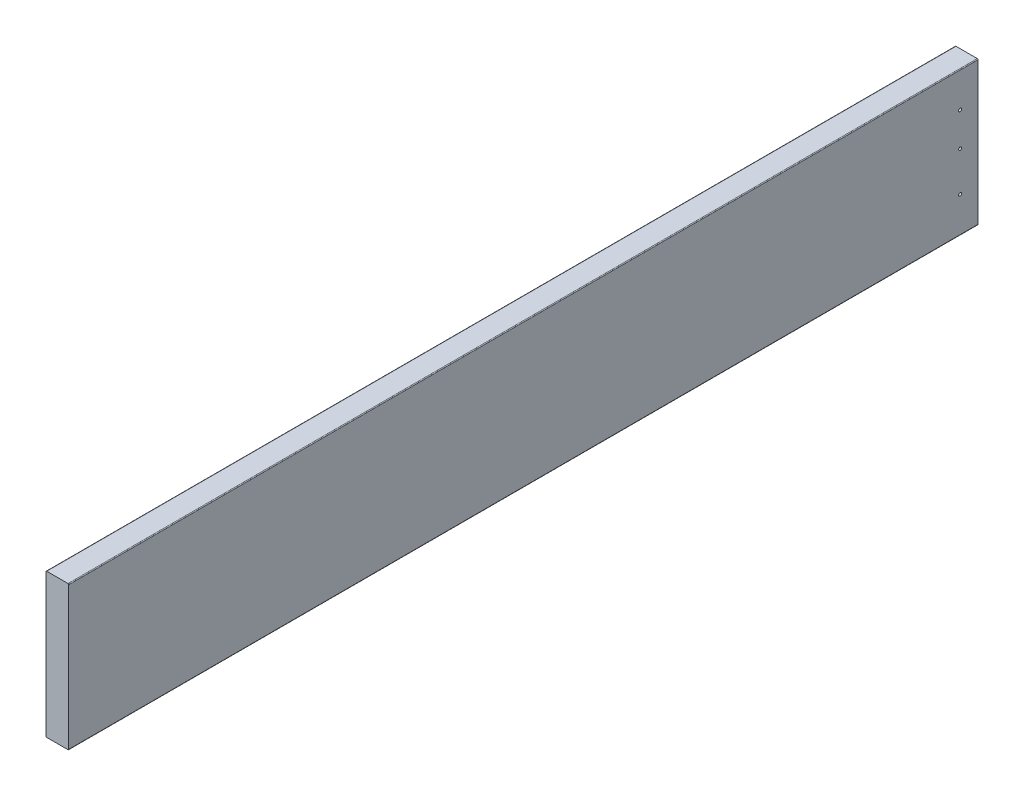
ISO-10303-21;
HEADER;
FILE_DESCRIPTION(('STEP AP214'),'2;1');
FILE_NAME('part.step','',(''),(''),'','','');
FILE_SCHEMA(('AUTOMOTIVE_DESIGN { 1 0 10303 214 1 1 1 1 }'));
ENDSEC;
DATA;
#1=APPLICATION_CONTEXT('core data for automotive mechanical design processes');
#2=APPLICATION_PROTOCOL_DEFINITION('international standard','automotive_design',2000,#1);
#3=PRODUCT_CONTEXT('',#1,'mechanical');
#4=PRODUCT('Part','Part','',(#3));
#5=PRODUCT_RELATED_PRODUCT_CATEGORY('part','',(#4));
#6=PRODUCT_DEFINITION_FORMATION('','',#4);
#7=PRODUCT_DEFINITION_CONTEXT('part definition',#1,'design');
#8=PRODUCT_DEFINITION('design','',#6,#7);
#9=PRODUCT_DEFINITION_SHAPE('','',#8);
#10=(LENGTH_UNIT() NAMED_UNIT(*) SI_UNIT(.MILLI.,.METRE.));
#11=(NAMED_UNIT(*) PLANE_ANGLE_UNIT() SI_UNIT($,.RADIAN.));
#12=(NAMED_UNIT(*) SI_UNIT($,.STERADIAN.) SOLID_ANGLE_UNIT());
#13=UNCERTAINTY_MEASURE_WITH_UNIT(LENGTH_MEASURE(1.E-05),#10,'distance_accuracy_value','');
#14=(GEOMETRIC_REPRESENTATION_CONTEXT(3) GLOBAL_UNCERTAINTY_ASSIGNED_CONTEXT((#13)) GLOBAL_UNIT_ASSIGNED_CONTEXT((#10,
#11,#12)) REPRESENTATION_CONTEXT('',''));
#15=CARTESIAN_POINT('',(0.,0.,0.));
#16=DIRECTION('',(0.,0.,1.));
#17=DIRECTION('',(1.,0.,0.));
#18=AXIS2_PLACEMENT_3D('',#15,#16,#17);
#19=CARTESIAN_POINT('',(-19.05,-120.65,1524.));
#20=DIRECTION('',(1.,0.,0.));
#21=DIRECTION('',(0.,0.,-1.));
#22=AXIS2_PLACEMENT_3D('',#19,#20,#21);
#23=PLANE('',#22);
#24=CARTESIAN_POINT('',(-19.05,61.645760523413,29.9999999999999));
#25=DIRECTION('',(-1.,0.,0.));
#26=DIRECTION('',(0.,0.,1.));
#27=AXIS2_PLACEMENT_3D('',#24,#25,#26);
#28=CIRCLE('',#27,2.50000000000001);
#29=CARTESIAN_POINT('',(-19.05,61.645760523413,32.4999999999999));
#30=VERTEX_POINT('',#29);
#31=EDGE_CURVE('E211',#30,#30,#28,.T.);
#32=ORIENTED_EDGE('',*,*,#31,.F.);
#33=EDGE_LOOP('',(#32));
#34=FACE_BOUND('',#33,.T.);
#35=CARTESIAN_POINT('',(-19.05,5.39576052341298,29.9999999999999));
#36=DIRECTION('',(-1.,0.,0.));
#37=DIRECTION('',(0.,0.,1.));
#38=AXIS2_PLACEMENT_3D('',#35,#36,#37);
#39=CIRCLE('',#38,2.5);
#40=CARTESIAN_POINT('',(-19.05,5.39576052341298,32.4999999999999));
#41=VERTEX_POINT('',#40);
#42=EDGE_CURVE('E205',#41,#41,#39,.T.);
#43=ORIENTED_EDGE('',*,*,#42,.F.);
#44=EDGE_LOOP('',(#43));
#45=FACE_BOUND('',#44,.T.);
#46=CARTESIAN_POINT('',(-19.05,-60.854239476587,29.9999999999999));
#47=DIRECTION('',(-1.,0.,0.));
#48=DIRECTION('',(0.,0.,1.));
#49=AXIS2_PLACEMENT_3D('',#46,#47,#48);
#50=CIRCLE('',#49,2.5);
#51=CARTESIAN_POINT('',(-19.05,-60.854239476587,32.4999999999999));
#52=VERTEX_POINT('',#51);
#53=EDGE_CURVE('E199',#52,#52,#50,.T.);
#54=ORIENTED_EDGE('',*,*,#53,.F.);
#55=EDGE_LOOP('',(#54));
#56=FACE_BOUND('',#55,.T.);
#57=DIRECTION('',(0.,-1.,0.));
#58=VECTOR('',#57,1.);
#59=CARTESIAN_POINT('',(-19.05,-120.65,0.));
#60=LINE('',#59,#58);
#61=CARTESIAN_POINT('',(-19.05,119.38,0.));
#62=VERTEX_POINT('',#61);
#63=CARTESIAN_POINT('',(-19.05,-119.38,0.));
#64=VERTEX_POINT('',#63);
#65=EDGE_CURVE('E131',#62,#64,#60,.T.);
#66=ORIENTED_EDGE('',*,*,#65,.T.);
#67=DIRECTION('',(0.,0.,-1.));
#68=VECTOR('',#67,1.);
#69=CARTESIAN_POINT('',(-19.05,-119.38,1524.));
#70=LINE('',#69,#68);
#71=CARTESIAN_POINT('',(-19.05,-119.38,1524.));
#72=VERTEX_POINT('',#71);
#73=EDGE_CURVE('E109',#64,#72,#70,.F.);
#74=ORIENTED_EDGE('',*,*,#73,.T.);
#75=DIRECTION('',(0.,-1.,0.));
#76=VECTOR('',#75,1.);
#77=CARTESIAN_POINT('',(-19.05,-120.65,1524.));
#78=LINE('',#77,#76);
#79=CARTESIAN_POINT('',(-19.05,119.38,1524.));
#80=VERTEX_POINT('',#79);
#81=EDGE_CURVE('E141',#80,#72,#78,.T.);
#82=ORIENTED_EDGE('',*,*,#81,.F.);
#83=DIRECTION('',(0.,0.,-1.));
#84=VECTOR('',#83,1.);
#85=CARTESIAN_POINT('',(-19.05,119.38,1524.));
#86=LINE('',#85,#84);
#87=EDGE_CURVE('E114',#80,#62,#86,.T.);
#88=ORIENTED_EDGE('',*,*,#87,.T.);
#89=EDGE_LOOP('',(#66,#74,#82,#88));
#90=FACE_BOUND('',#89,.T.);
#91=ADVANCED_FACE('F38',(#34,#45,#56,#90),#23,.F.);
#92=CARTESIAN_POINT('',(-19.05,-120.65,1524.));
#93=DIRECTION('',(0.,1.,0.));
#94=DIRECTION('',(0.,0.,1.));
#95=AXIS2_PLACEMENT_3D('',#92,#93,#94);
#96=PLANE('',#95);
#97=DIRECTION('',(1.,0.,0.));
#98=VECTOR('',#97,1.);
#99=CARTESIAN_POINT('',(-19.05,-120.65,1524.));
#100=LINE('',#99,#98);
#101=CARTESIAN_POINT('',(-17.78,-120.65,1524.));
#102=VERTEX_POINT('',#101);
#103=CARTESIAN_POINT('',(17.78,-120.65,1524.));
#104=VERTEX_POINT('',#103);
#105=EDGE_CURVE('E124',#102,#104,#100,.T.);
#106=ORIENTED_EDGE('',*,*,#105,.F.);
#107=DIRECTION('',(0.,0.,-1.));
#108=VECTOR('',#107,1.);
#109=CARTESIAN_POINT('',(-17.78,-120.65,1524.));
#110=LINE('',#109,#108);
#111=CARTESIAN_POINT('',(-17.78,-120.65,0.));
#112=VERTEX_POINT('',#111);
#113=EDGE_CURVE('E108',#102,#112,#110,.T.);
#114=ORIENTED_EDGE('',*,*,#113,.T.);
#115=DIRECTION('',(1.,0.,0.));
#116=VECTOR('',#115,1.);
#117=CARTESIAN_POINT('',(-19.05,-120.65,0.));
#118=LINE('',#117,#116);
#119=CARTESIAN_POINT('',(17.78,-120.65,0.));
#120=VERTEX_POINT('',#119);
#121=EDGE_CURVE('E121',#112,#120,#118,.T.);
#122=ORIENTED_EDGE('',*,*,#121,.T.);
#123=DIRECTION('',(0.,0.,-1.));
#124=VECTOR('',#123,1.);
#125=CARTESIAN_POINT('',(17.78,-120.65,1524.));
#126=LINE('',#125,#124);
#127=EDGE_CURVE('E126',#120,#104,#126,.F.);
#128=ORIENTED_EDGE('',*,*,#127,.T.);
#129=EDGE_LOOP('',(#106,#114,#122,#128));
#130=FACE_BOUND('',#129,.T.);
#131=ADVANCED_FACE('F120',(#130),#96,.F.);
#132=CARTESIAN_POINT('',(19.05,-120.65,1524.));
#133=DIRECTION('',(-1.,0.,0.));
#134=DIRECTION('',(0.,-1.,0.));
#135=AXIS2_PLACEMENT_3D('',#132,#133,#134);
#136=PLANE('',#135);
#137=CARTESIAN_POINT('',(19.05,61.6457605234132,30.0000000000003));
#138=DIRECTION('',(1.,0.,0.));
#139=DIRECTION('',(0.,1.,0.));
#140=AXIS2_PLACEMENT_3D('',#137,#138,#139);
#141=CIRCLE('',#140,2.5);
#142=CARTESIAN_POINT('',(19.05,64.1457605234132,30.0000000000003));
#143=VERTEX_POINT('',#142);
#144=EDGE_CURVE('E193',#143,#143,#141,.T.);
#145=ORIENTED_EDGE('',*,*,#144,.F.);
#146=EDGE_LOOP('',(#145));
#147=FACE_BOUND('',#146,.T.);
#148=CARTESIAN_POINT('',(19.05,5.39576052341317,30.0000000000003));
#149=DIRECTION('',(1.,0.,0.));
#150=DIRECTION('',(0.,1.,0.));
#151=AXIS2_PLACEMENT_3D('',#148,#149,#150);
#152=CIRCLE('',#151,2.5);
#153=CARTESIAN_POINT('',(19.05,7.89576052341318,30.0000000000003));
#154=VERTEX_POINT('',#153);
#155=EDGE_CURVE('E187',#154,#154,#152,.T.);
#156=ORIENTED_EDGE('',*,*,#155,.F.);
#157=EDGE_LOOP('',(#156));
#158=FACE_BOUND('',#157,.T.);
#159=CARTESIAN_POINT('',(19.05,-60.8542394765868,30.0000000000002));
#160=DIRECTION('',(1.,0.,0.));
#161=DIRECTION('',(0.,1.,0.));
#162=AXIS2_PLACEMENT_3D('',#159,#160,#161);
#163=CIRCLE('',#162,2.50000000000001);
#164=CARTESIAN_POINT('',(19.05,-58.3542394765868,30.0000000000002));
#165=VERTEX_POINT('',#164);
#166=EDGE_CURVE('E181',#165,#165,#163,.T.);
#167=ORIENTED_EDGE('',*,*,#166,.F.);
#168=EDGE_LOOP('',(#167));
#169=FACE_BOUND('',#168,.T.);
#170=DIRECTION('',(0.,1.,0.));
#171=VECTOR('',#170,1.);
#172=CARTESIAN_POINT('',(19.05,-120.65,1524.));
#173=LINE('',#172,#171);
#174=CARTESIAN_POINT('',(19.05,-119.38,1524.));
#175=VERTEX_POINT('',#174);
#176=CARTESIAN_POINT('',(19.05,119.38,1524.));
#177=VERTEX_POINT('',#176);
#178=EDGE_CURVE('E167',#175,#177,#173,.T.);
#179=ORIENTED_EDGE('',*,*,#178,.F.);
#180=DIRECTION('',(0.,0.,-1.));
#181=VECTOR('',#180,1.);
#182=CARTESIAN_POINT('',(19.05,-119.38,1524.));
#183=LINE('',#182,#181);
#184=CARTESIAN_POINT('',(19.05,-119.38,0.));
#185=VERTEX_POINT('',#184);
#186=EDGE_CURVE('E160',#175,#185,#183,.T.);
#187=ORIENTED_EDGE('',*,*,#186,.T.);
#188=DIRECTION('',(0.,1.,0.));
#189=VECTOR('',#188,1.);
#190=CARTESIAN_POINT('',(19.05,-120.65,0.));
#191=LINE('',#190,#189);
#192=CARTESIAN_POINT('',(19.05,119.38,0.));
#193=VERTEX_POINT('',#192);
#194=EDGE_CURVE('E130',#185,#193,#191,.T.);
#195=ORIENTED_EDGE('',*,*,#194,.T.);
#196=DIRECTION('',(0.,0.,-1.));
#197=VECTOR('',#196,1.);
#198=CARTESIAN_POINT('',(19.05,119.38,1524.));
#199=LINE('',#198,#197);
#200=EDGE_CURVE('E158',#193,#177,#199,.F.);
#201=ORIENTED_EDGE('',*,*,#200,.T.);
#202=EDGE_LOOP('',(#179,#187,#195,#201));
#203=FACE_BOUND('',#202,.T.);
#204=ADVANCED_FACE('F165',(#147,#158,#169,#203),#136,.F.);
#205=CARTESIAN_POINT('',(-19.05,120.65,1524.));
#206=DIRECTION('',(0.,-1.,0.));
#207=DIRECTION('',(0.,0.,-1.));
#208=AXIS2_PLACEMENT_3D('',#205,#206,#207);
#209=PLANE('',#208);
#210=DIRECTION('',(-1.,0.,0.));
#211=VECTOR('',#210,1.);
#212=CARTESIAN_POINT('',(-19.05,120.65,1524.));
#213=LINE('',#212,#211);
#214=CARTESIAN_POINT('',(17.78,120.65,1524.));
#215=VERTEX_POINT('',#214);
#216=CARTESIAN_POINT('',(-17.78,120.65,1524.));
#217=VERTEX_POINT('',#216);
#218=EDGE_CURVE('E142',#215,#217,#213,.T.);
#219=ORIENTED_EDGE('',*,*,#218,.F.);
#220=DIRECTION('',(0.,0.,-1.));
#221=VECTOR('',#220,1.);
#222=CARTESIAN_POINT('',(17.78,120.65,1524.));
#223=LINE('',#222,#221);
#224=CARTESIAN_POINT('',(17.78,120.65,0.));
#225=VERTEX_POINT('',#224);
#226=EDGE_CURVE('E12',#215,#225,#223,.T.);
#227=ORIENTED_EDGE('',*,*,#226,.T.);
#228=DIRECTION('',(-1.,0.,0.));
#229=VECTOR('',#228,1.);
#230=CARTESIAN_POINT('',(-19.05,120.65,0.));
#231=LINE('',#230,#229);
#232=CARTESIAN_POINT('',(-17.78,120.65,0.));
#233=VERTEX_POINT('',#232);
#234=EDGE_CURVE('E134',#225,#233,#231,.T.);
#235=ORIENTED_EDGE('',*,*,#234,.T.);
#236=DIRECTION('',(0.,0.,-1.));
#237=VECTOR('',#236,1.);
#238=CARTESIAN_POINT('',(-17.78,120.65,1524.));
#239=LINE('',#238,#237);
#240=EDGE_CURVE('E46',#233,#217,#239,.F.);
#241=ORIENTED_EDGE('',*,*,#240,.T.);
#242=EDGE_LOOP('',(#219,#227,#235,#241));
#243=FACE_BOUND('',#242,.T.);
#244=ADVANCED_FACE('F174',(#243),#209,.F.);
#245=CARTESIAN_POINT('',(-19.05,120.65,1524.));
#246=DIRECTION('',(0.,0.,-1.));
#247=DIRECTION('',(-1.,0.,0.));
#248=AXIS2_PLACEMENT_3D('',#245,#246,#247);
#249=PLANE('',#248);
#250=ORIENTED_EDGE('',*,*,#81,.T.);
#251=CARTESIAN_POINT('',(-17.78,-119.38,1524.));
#252=DIRECTION('',(0.,0.,-1.));
#253=DIRECTION('',(-1.,0.,0.));
#254=AXIS2_PLACEMENT_3D('',#251,#252,#253);
#255=CIRCLE('',#254,1.27);
#256=EDGE_CURVE('E156',#72,#102,#255,.F.);
#257=ORIENTED_EDGE('',*,*,#256,.T.);
#258=ORIENTED_EDGE('',*,*,#105,.T.);
#259=CARTESIAN_POINT('',(17.78,-119.38,1524.));
#260=DIRECTION('',(0.,0.,-1.));
#261=DIRECTION('',(-1.,0.,0.));
#262=AXIS2_PLACEMENT_3D('',#259,#260,#261);
#263=CIRCLE('',#262,1.27);
#264=EDGE_CURVE('E154',#104,#175,#263,.F.);
#265=ORIENTED_EDGE('',*,*,#264,.T.);
#266=ORIENTED_EDGE('',*,*,#178,.T.);
#267=CARTESIAN_POINT('',(17.78,119.38,1524.));
#268=DIRECTION('',(0.,0.,-1.));
#269=DIRECTION('',(-1.,0.,0.));
#270=AXIS2_PLACEMENT_3D('',#267,#268,#269);
#271=CIRCLE('',#270,1.27);
#272=EDGE_CURVE('E59',#177,#215,#271,.F.);
#273=ORIENTED_EDGE('',*,*,#272,.T.);
#274=ORIENTED_EDGE('',*,*,#218,.T.);
#275=CARTESIAN_POINT('',(-17.78,119.38,1524.));
#276=DIRECTION('',(0.,0.,-1.));
#277=DIRECTION('',(-1.,0.,0.));
#278=AXIS2_PLACEMENT_3D('',#275,#276,#277);
#279=CIRCLE('',#278,1.27);
#280=EDGE_CURVE('E151',#217,#80,#279,.F.);
#281=ORIENTED_EDGE('',*,*,#280,.T.);
#282=EDGE_LOOP('',(#250,#257,#258,#265,#266,#273,#274,#281));
#283=FACE_BOUND('',#282,.T.);
#284=ADVANCED_FACE('F236',(#283),#249,.F.);
#285=CARTESIAN_POINT('',(-19.05,120.65,0.));
#286=DIRECTION('',(0.,0.,-1.));
#287=DIRECTION('',(-1.,0.,0.));
#288=AXIS2_PLACEMENT_3D('',#285,#286,#287);
#289=PLANE('',#288);
#290=ORIENTED_EDGE('',*,*,#121,.F.);
#291=CARTESIAN_POINT('',(-17.78,-119.38,0.));
#292=DIRECTION('',(0.,0.,-1.));
#293=DIRECTION('',(-1.,0.,0.));
#294=AXIS2_PLACEMENT_3D('',#291,#292,#293);
#295=CIRCLE('',#294,1.27);
#296=EDGE_CURVE('E104',#112,#64,#295,.T.);
#297=ORIENTED_EDGE('',*,*,#296,.T.);
#298=ORIENTED_EDGE('',*,*,#65,.F.);
#299=CARTESIAN_POINT('',(-17.78,119.38,0.));
#300=DIRECTION('',(0.,0.,-1.));
#301=DIRECTION('',(-1.,0.,0.));
#302=AXIS2_PLACEMENT_3D('',#299,#300,#301);
#303=CIRCLE('',#302,1.27);
#304=EDGE_CURVE('E125',#62,#233,#303,.T.);
#305=ORIENTED_EDGE('',*,*,#304,.T.);
#306=ORIENTED_EDGE('',*,*,#234,.F.);
#307=CARTESIAN_POINT('',(17.78,119.38,0.));
#308=DIRECTION('',(0.,0.,-1.));
#309=DIRECTION('',(-1.,0.,0.));
#310=AXIS2_PLACEMENT_3D('',#307,#308,#309);
#311=CIRCLE('',#310,1.27);
#312=EDGE_CURVE('E145',#225,#193,#311,.T.);
#313=ORIENTED_EDGE('',*,*,#312,.T.);
#314=ORIENTED_EDGE('',*,*,#194,.F.);
#315=CARTESIAN_POINT('',(17.78,-119.38,0.));
#316=DIRECTION('',(0.,0.,-1.));
#317=DIRECTION('',(-1.,0.,0.));
#318=AXIS2_PLACEMENT_3D('',#315,#316,#317);
#319=CIRCLE('',#318,1.27);
#320=EDGE_CURVE('E115',#185,#120,#319,.T.);
#321=ORIENTED_EDGE('',*,*,#320,.T.);
#322=EDGE_LOOP('',(#290,#297,#298,#305,#306,#313,#314,#321));
#323=FACE_BOUND('',#322,.T.);
#324=ADVANCED_FACE('F128',(#323),#289,.T.);
#325=CARTESIAN_POINT('',(-17.78,-119.38,1524.));
#326=DIRECTION('',(0.,0.,-1.));
#327=DIRECTION('',(-1.,0.,0.));
#328=AXIS2_PLACEMENT_3D('',#325,#326,#327);
#329=CYLINDRICAL_SURFACE('',#328,1.27);
#330=ORIENTED_EDGE('',*,*,#256,.F.);
#331=ORIENTED_EDGE('',*,*,#73,.F.);
#332=ORIENTED_EDGE('',*,*,#296,.F.);
#333=ORIENTED_EDGE('',*,*,#113,.F.);
#334=EDGE_LOOP('',(#330,#331,#332,#333));
#335=FACE_BOUND('',#334,.T.);
#336=ADVANCED_FACE('F107',(#335),#329,.T.);
#337=CARTESIAN_POINT('',(17.78,-119.38,1524.));
#338=DIRECTION('',(0.,0.,-1.));
#339=DIRECTION('',(-1.,0.,0.));
#340=AXIS2_PLACEMENT_3D('',#337,#338,#339);
#341=CYLINDRICAL_SURFACE('',#340,1.27);
#342=ORIENTED_EDGE('',*,*,#264,.F.);
#343=ORIENTED_EDGE('',*,*,#127,.F.);
#344=ORIENTED_EDGE('',*,*,#320,.F.);
#345=ORIENTED_EDGE('',*,*,#186,.F.);
#346=EDGE_LOOP('',(#342,#343,#344,#345));
#347=FACE_BOUND('',#346,.T.);
#348=ADVANCED_FACE('F237',(#347),#341,.T.);
#349=CARTESIAN_POINT('',(17.78,119.38,1524.));
#350=DIRECTION('',(0.,0.,-1.));
#351=DIRECTION('',(-1.,0.,0.));
#352=AXIS2_PLACEMENT_3D('',#349,#350,#351);
#353=CYLINDRICAL_SURFACE('',#352,1.27);
#354=ORIENTED_EDGE('',*,*,#272,.F.);
#355=ORIENTED_EDGE('',*,*,#200,.F.);
#356=ORIENTED_EDGE('',*,*,#312,.F.);
#357=ORIENTED_EDGE('',*,*,#226,.F.);
#358=EDGE_LOOP('',(#354,#355,#356,#357));
#359=FACE_BOUND('',#358,.T.);
#360=ADVANCED_FACE('F173',(#359),#353,.T.);
#361=CARTESIAN_POINT('',(-17.78,119.38,1524.));
#362=DIRECTION('',(0.,0.,-1.));
#363=DIRECTION('',(-1.,0.,0.));
#364=AXIS2_PLACEMENT_3D('',#361,#362,#363);
#365=CYLINDRICAL_SURFACE('',#364,1.27);
#366=ORIENTED_EDGE('',*,*,#280,.F.);
#367=ORIENTED_EDGE('',*,*,#240,.F.);
#368=ORIENTED_EDGE('',*,*,#304,.F.);
#369=ORIENTED_EDGE('',*,*,#87,.F.);
#370=EDGE_LOOP('',(#366,#367,#368,#369));
#371=FACE_BOUND('',#370,.T.);
#372=ADVANCED_FACE('F40',(#371),#365,.T.);
#373=CARTESIAN_POINT('',(1.27,-60.8542394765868,30.0000000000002));
#374=DIRECTION('',(1.,0.,0.));
#375=DIRECTION('',(0.,1.,0.));
#376=AXIS2_PLACEMENT_3D('',#373,#374,#375);
#377=CYLINDRICAL_SURFACE('',#376,2.50000000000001);
#378=CARTESIAN_POINT('',(1.27,-60.8542394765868,30.0000000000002));
#379=DIRECTION('',(1.,0.,0.));
#380=DIRECTION('',(0.,1.,0.));
#381=AXIS2_PLACEMENT_3D('',#378,#379,#380);
#382=CIRCLE('',#381,2.50000000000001);
#383=CARTESIAN_POINT('',(1.27,-58.3542394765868,30.0000000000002));
#384=VERTEX_POINT('',#383);
#385=EDGE_CURVE('E136',#384,#384,#382,.T.);
#386=ORIENTED_EDGE('',*,*,#385,.F.);
#387=EDGE_LOOP('',(#386));
#388=FACE_BOUND('',#387,.T.);
#389=ORIENTED_EDGE('',*,*,#166,.T.);
#390=EDGE_LOOP('',(#389));
#391=FACE_BOUND('',#390,.T.);
#392=ADVANCED_FACE('F257',(#388,#391),#377,.F.);
#393=CARTESIAN_POINT('',(1.27,-60.8542394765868,30.0000000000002));
#394=DIRECTION('',(1.,0.,0.));
#395=DIRECTION('',(0.,1.,0.));
#396=AXIS2_PLACEMENT_3D('',#393,#394,#395);
#397=PLANE('',#396);
#398=ORIENTED_EDGE('',*,*,#385,.T.);
#399=EDGE_LOOP('',(#398));
#400=FACE_BOUND('',#399,.T.);
#401=ADVANCED_FACE('F260',(#400),#397,.T.);
#402=CARTESIAN_POINT('',(1.27,5.39576052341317,30.0000000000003));
#403=DIRECTION('',(1.,0.,0.));
#404=DIRECTION('',(0.,1.,0.));
#405=AXIS2_PLACEMENT_3D('',#402,#403,#404);
#406=CYLINDRICAL_SURFACE('',#405,2.5);
#407=CARTESIAN_POINT('',(1.27,5.39576052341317,30.0000000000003));
#408=DIRECTION('',(1.,0.,0.));
#409=DIRECTION('',(0.,1.,0.));
#410=AXIS2_PLACEMENT_3D('',#407,#408,#409);
#411=CIRCLE('',#410,2.5);
#412=CARTESIAN_POINT('',(1.27,7.89576052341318,30.0000000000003));
#413=VERTEX_POINT('',#412);
#414=EDGE_CURVE('E184',#413,#413,#411,.T.);
#415=ORIENTED_EDGE('',*,*,#414,.F.);
#416=EDGE_LOOP('',(#415));
#417=FACE_BOUND('',#416,.T.);
#418=ORIENTED_EDGE('',*,*,#155,.T.);
#419=EDGE_LOOP('',(#418));
#420=FACE_BOUND('',#419,.T.);
#421=ADVANCED_FACE('F264',(#417,#420),#406,.F.);
#422=CARTESIAN_POINT('',(1.27,5.39576052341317,30.0000000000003));
#423=DIRECTION('',(1.,0.,0.));
#424=DIRECTION('',(0.,1.,0.));
#425=AXIS2_PLACEMENT_3D('',#422,#423,#424);
#426=PLANE('',#425);
#427=ORIENTED_EDGE('',*,*,#414,.T.);
#428=EDGE_LOOP('',(#427));
#429=FACE_BOUND('',#428,.T.);
#430=ADVANCED_FACE('F268',(#429),#426,.T.);
#431=CARTESIAN_POINT('',(1.27,61.6457605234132,30.0000000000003));
#432=DIRECTION('',(1.,0.,0.));
#433=DIRECTION('',(0.,1.,0.));
#434=AXIS2_PLACEMENT_3D('',#431,#432,#433);
#435=CYLINDRICAL_SURFACE('',#434,2.5);
#436=CARTESIAN_POINT('',(1.27,61.6457605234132,30.0000000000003));
#437=DIRECTION('',(1.,0.,0.));
#438=DIRECTION('',(0.,1.,0.));
#439=AXIS2_PLACEMENT_3D('',#436,#437,#438);
#440=CIRCLE('',#439,2.5);
#441=CARTESIAN_POINT('',(1.27,64.1457605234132,30.0000000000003));
#442=VERTEX_POINT('',#441);
#443=EDGE_CURVE('E190',#442,#442,#440,.T.);
#444=ORIENTED_EDGE('',*,*,#443,.F.);
#445=EDGE_LOOP('',(#444));
#446=FACE_BOUND('',#445,.T.);
#447=ORIENTED_EDGE('',*,*,#144,.T.);
#448=EDGE_LOOP('',(#447));
#449=FACE_BOUND('',#448,.T.);
#450=ADVANCED_FACE('F272',(#446,#449),#435,.F.);
#451=CARTESIAN_POINT('',(1.27,61.6457605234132,30.0000000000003));
#452=DIRECTION('',(1.,0.,0.));
#453=DIRECTION('',(0.,1.,0.));
#454=AXIS2_PLACEMENT_3D('',#451,#452,#453);
#455=PLANE('',#454);
#456=ORIENTED_EDGE('',*,*,#443,.T.);
#457=EDGE_LOOP('',(#456));
#458=FACE_BOUND('',#457,.T.);
#459=ADVANCED_FACE('F276',(#458),#455,.T.);
#460=CARTESIAN_POINT('',(-1.27000000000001,-60.854239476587,29.9999999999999));
#461=DIRECTION('',(-1.,0.,0.));
#462=DIRECTION('',(0.,0.,1.));
#463=AXIS2_PLACEMENT_3D('',#460,#461,#462);
#464=CYLINDRICAL_SURFACE('',#463,2.5);
#465=CARTESIAN_POINT('',(-1.27000000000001,-60.854239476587,29.9999999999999));
#466=DIRECTION('',(-1.,0.,0.));
#467=DIRECTION('',(0.,0.,1.));
#468=AXIS2_PLACEMENT_3D('',#465,#466,#467);
#469=CIRCLE('',#468,2.5);
#470=CARTESIAN_POINT('',(-1.27000000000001,-60.854239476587,32.4999999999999));
#471=VERTEX_POINT('',#470);
#472=EDGE_CURVE('E196',#471,#471,#469,.T.);
#473=ORIENTED_EDGE('',*,*,#472,.F.);
#474=EDGE_LOOP('',(#473));
#475=FACE_BOUND('',#474,.T.);
#476=ORIENTED_EDGE('',*,*,#53,.T.);
#477=EDGE_LOOP('',(#476));
#478=FACE_BOUND('',#477,.T.);
#479=ADVANCED_FACE('F280',(#475,#478),#464,.F.);
#480=CARTESIAN_POINT('',(-1.27000000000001,-60.854239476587,29.9999999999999));
#481=DIRECTION('',(-1.,0.,0.));
#482=DIRECTION('',(0.,0.,1.));
#483=AXIS2_PLACEMENT_3D('',#480,#481,#482);
#484=PLANE('',#483);
#485=ORIENTED_EDGE('',*,*,#472,.T.);
#486=EDGE_LOOP('',(#485));
#487=FACE_BOUND('',#486,.T.);
#488=ADVANCED_FACE('F284',(#487),#484,.T.);
#489=CARTESIAN_POINT('',(-1.27000000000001,5.39576052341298,29.9999999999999));
#490=DIRECTION('',(-1.,0.,0.));
#491=DIRECTION('',(0.,0.,1.));
#492=AXIS2_PLACEMENT_3D('',#489,#490,#491);
#493=CYLINDRICAL_SURFACE('',#492,2.5);
#494=CARTESIAN_POINT('',(-1.27000000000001,5.39576052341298,29.9999999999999));
#495=DIRECTION('',(-1.,0.,0.));
#496=DIRECTION('',(0.,0.,1.));
#497=AXIS2_PLACEMENT_3D('',#494,#495,#496);
#498=CIRCLE('',#497,2.5);
#499=CARTESIAN_POINT('',(-1.27000000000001,5.39576052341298,32.4999999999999));
#500=VERTEX_POINT('',#499);
#501=EDGE_CURVE('E202',#500,#500,#498,.T.);
#502=ORIENTED_EDGE('',*,*,#501,.F.);
#503=EDGE_LOOP('',(#502));
#504=FACE_BOUND('',#503,.T.);
#505=ORIENTED_EDGE('',*,*,#42,.T.);
#506=EDGE_LOOP('',(#505));
#507=FACE_BOUND('',#506,.T.);
#508=ADVANCED_FACE('F288',(#504,#507),#493,.F.);
#509=CARTESIAN_POINT('',(-1.27000000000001,5.39576052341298,29.9999999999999));
#510=DIRECTION('',(-1.,0.,0.));
#511=DIRECTION('',(0.,0.,1.));
#512=AXIS2_PLACEMENT_3D('',#509,#510,#511);
#513=PLANE('',#512);
#514=ORIENTED_EDGE('',*,*,#501,.T.);
#515=EDGE_LOOP('',(#514));
#516=FACE_BOUND('',#515,.T.);
#517=ADVANCED_FACE('F222',(#516),#513,.T.);
#518=CARTESIAN_POINT('',(-1.27000000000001,61.645760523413,29.9999999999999));
#519=DIRECTION('',(-1.,0.,0.));
#520=DIRECTION('',(0.,0.,1.));
#521=AXIS2_PLACEMENT_3D('',#518,#519,#520);
#522=CYLINDRICAL_SURFACE('',#521,2.50000000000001);
#523=CARTESIAN_POINT('',(-1.27000000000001,61.645760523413,29.9999999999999));
#524=DIRECTION('',(-1.,0.,0.));
#525=DIRECTION('',(0.,0.,1.));
#526=AXIS2_PLACEMENT_3D('',#523,#524,#525);
#527=CIRCLE('',#526,2.50000000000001);
#528=CARTESIAN_POINT('',(-1.27000000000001,61.645760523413,32.4999999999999));
#529=VERTEX_POINT('',#528);
#530=EDGE_CURVE('E208',#529,#529,#527,.T.);
#531=ORIENTED_EDGE('',*,*,#530,.F.);
#532=EDGE_LOOP('',(#531));
#533=FACE_BOUND('',#532,.T.);
#534=ORIENTED_EDGE('',*,*,#31,.T.);
#535=EDGE_LOOP('',(#534));
#536=FACE_BOUND('',#535,.T.);
#537=ADVANCED_FACE('F219',(#533,#536),#522,.F.);
#538=CARTESIAN_POINT('',(-1.27000000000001,61.645760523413,29.9999999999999));
#539=DIRECTION('',(-1.,0.,0.));
#540=DIRECTION('',(0.,0.,1.));
#541=AXIS2_PLACEMENT_3D('',#538,#539,#540);
#542=PLANE('',#541);
#543=ORIENTED_EDGE('',*,*,#530,.T.);
#544=EDGE_LOOP('',(#543));
#545=FACE_BOUND('',#544,.T.);
#546=ADVANCED_FACE('F217',(#545),#542,.T.);
#547=CLOSED_SHELL('',(#91,#131,#204,#244,#284,#324,#336,#348,#360,#372,#392,#401,#421,#430,#450,
#459,#479,#488,#508,#517,#537,#546));
#548=MANIFOLD_SOLID_BREP('B2',#547);
#549=ADVANCED_BREP_SHAPE_REPRESENTATION('',(#18,#548),#14);
#550=SHAPE_DEFINITION_REPRESENTATION(#9,#549);
ENDSEC;
END-ISO-10303-21;
